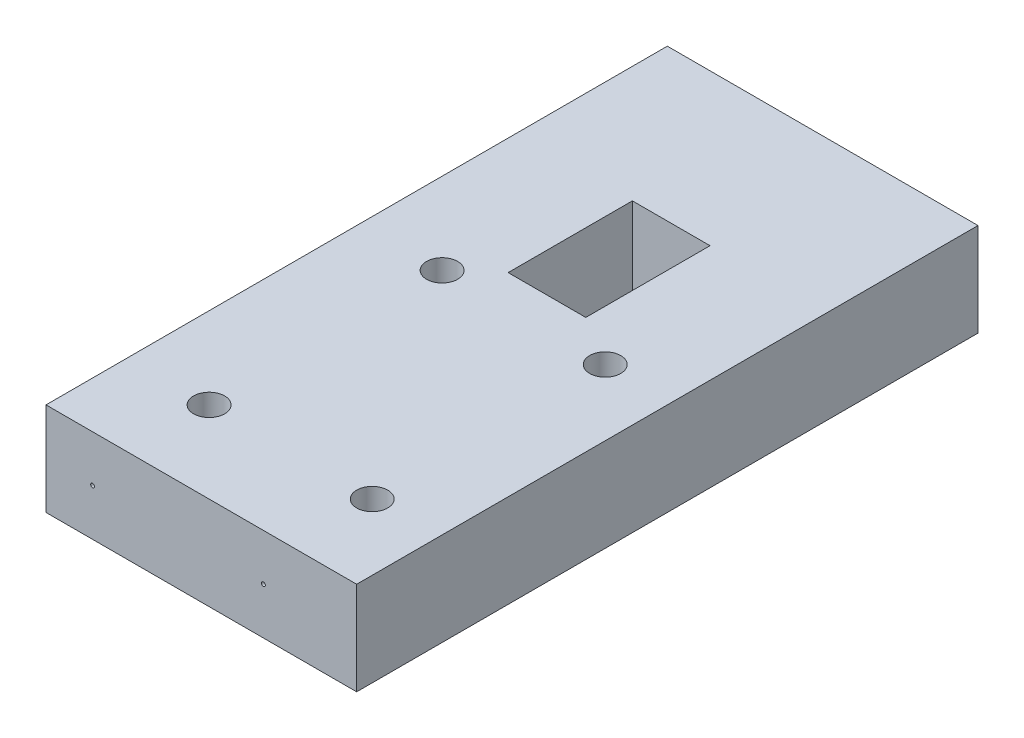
from build123d import *

# Parameters (mm, degrees)
SKETCH1_W                          = 127
SKETCH1_H                          = 254
SKETCH1_W_2                        = 31.75
SKETCH1_H_2                        = 50.8
BOSS_EXTRUDE1_DEPTH                = 38.1
F_1_2_0_5_DIAMETER_HOLE1_D         = 12.7
F_1_16_0_0625_DIAMETER_HOLE3_D     = 1.5875
F_1_16_0_0625_DIAMETER_HOLE3_DEPTH = 38.1
F_1_16_0_0625_DIAMETER_HOLE3_TIP   = 0.476933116
F_1_16_0_0625_DIAMETER_HOLE4_D     = 1.5875
F_1_16_0_0625_DIAMETER_HOLE4_DEPTH = 38.1
F_1_16_0_0625_DIAMETER_HOLE4_TIP   = 0.476933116


with BuildPart() as part:
    # Sketch1 → Boss-Extrude1 (new body)
    with BuildSketch(Plane(origin=(0, 0, 0), x_dir=(1, 0, 0), z_dir=(0, 1, 0))):
        Rectangle(SKETCH1_W, SKETCH1_H)
        with Locations((-1.1e-08, 39.687489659)):
            Rectangle(SKETCH1_W_2, SKETCH1_H_2, mode=Mode.SUBTRACT)
    extrude(amount=BOSS_EXTRUDE1_DEPTH)

    # 1_2 _0.5_ Diameter Hole1 (through all)
    with Locations(Plane(origin=(0, 38.1, 0), x_dir=(1, 0, 0), z_dir=(0, 1, 0))):
        with Locations((-30.1625, 1.5875), (-30.1625, -93.6625), (36.5125, 1.5875), (36.5125, -93.6625)):
            Hole(F_1_2_0_5_DIAMETER_HOLE1_D / 2)

    # 1_16 _0.0625_ Diameter Hole3
    with Locations(Plane.XY.offset(127)):
        with Locations((-44.45, 19.05), (25.4, 19.05)):
            Hole(F_1_16_0_0625_DIAMETER_HOLE3_D / 2, depth=F_1_16_0_0625_DIAMETER_HOLE3_DEPTH)
            with Locations((0, 0, -(F_1_16_0_0625_DIAMETER_HOLE3_DEPTH + F_1_16_0_0625_DIAMETER_HOLE3_TIP / 2))):  # 118° drill point
                Cone(0, F_1_16_0_0625_DIAMETER_HOLE3_D / 2, F_1_16_0_0625_DIAMETER_HOLE3_TIP, mode=Mode.SUBTRACT)

    # 1_16 _0.0625_ Diameter Hole4
    with Locations(Plane(origin=(0, 0, -127), x_dir=(-1, 0, 0), z_dir=(0, 0, -1))):
        with Locations((-25.4, 19.05), (44.45, 19.05)):
            Hole(F_1_16_0_0625_DIAMETER_HOLE4_D / 2, depth=F_1_16_0_0625_DIAMETER_HOLE4_DEPTH)
            with Locations((0, 0, -(F_1_16_0_0625_DIAMETER_HOLE4_DEPTH + F_1_16_0_0625_DIAMETER_HOLE4_TIP / 2))):  # 118° drill point
                Cone(0, F_1_16_0_0625_DIAMETER_HOLE4_D / 2, F_1_16_0_0625_DIAMETER_HOLE4_TIP, mode=Mode.SUBTRACT)


solid = part.part
